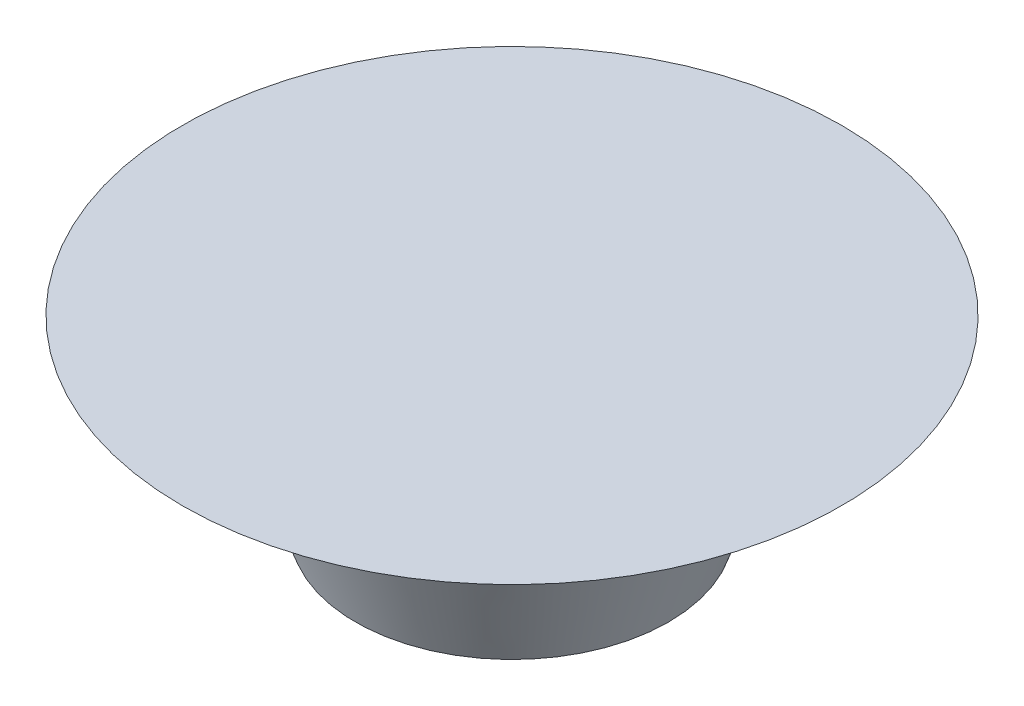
from build123d import *

# Parameters (mm, degrees)
SKETCH1_W          = 50
SKETCH1_H          = 1
BASE_EXTRUDE_DEPTH = 25
FILLET1_R          = 4
SKETCH3_W          = 50
SKETCH3_H          = 1
CUT_EXTRUDE1_DEPTH = 57.124860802


with BuildPart() as part:
    # Sketch1 → Base-Extrude (new, symmetric)
    with BuildSketch(Plane.XY):
        with Locations((0, 0.5)):
            Rectangle(SKETCH1_W, SKETCH1_H)
    extrude(amount=BASE_EXTRUDE_DEPTH, both=True)

    # Sketch2 → Boss-Revolve1 (revolve)
    with BuildSketch(Plane.XY, mode=Mode.PRIVATE) as boss_revolve1_sk:
        Polygon((6, 0), (4.180148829, -5), (0, -5), (0, 0), align=None)
    revolve(boss_revolve1_sk.sketch.rotate(Axis((0, 5.617399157, 0), (0, -1, 0)), 180), axis=Axis((0, 5.617399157, 0), (0, -1, 0)))

    # Fillet1
    fillet1_edges = [part.edges().sort_by_distance(p)[0] for p in [
        (6, 0, 0),
    ]]
    fillet(fillet1_edges, radius=FILLET1_R)

    # Sketch3 → Cut-Extrude1 (cut, through all)
    with BuildSketch(Plane(origin=(25, 0, 0), x_dir=(0, 0, -1), z_dir=(1, 0, 0))):
        with Locations((0, 0.5)):
            Rectangle(SKETCH3_W, SKETCH3_H)
    extrude(amount=-CUT_EXTRUDE1_DEPTH, mode=Mode.SUBTRACT)


solid = part.part
